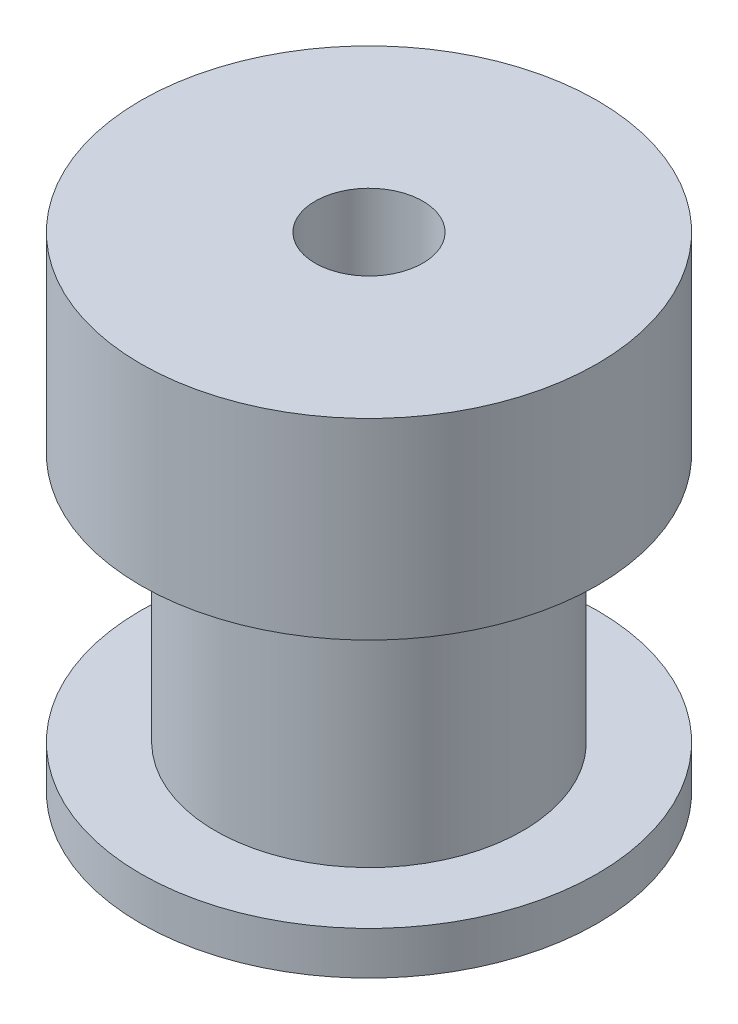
from build123d import *

# Parameters (mm, degrees)
SKETCH1_R           = 6.731
BOSS_EXTRUDE1_DEPTH = 14.3002
SKETCH2_W           = 2.1971
SKETCH2_H           = 7.366
SKETCH3_R           = 1.5875
CUT_EXTRUDE1_DEPTH  = 18.178720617


with BuildPart() as part:
    # Sketch1 → Boss-Extrude1 (new body)
    with BuildSketch(Plane(origin=(0, 0, 0), x_dir=(1, 0, 0), z_dir=(0, 1, 0))):
        with Locations(Location((0, 0, 0), (0, 0, 270))):
            Circle(SKETCH1_R)
    extrude(amount=BOSS_EXTRUDE1_DEPTH)

    # Sketch2 → Cut-Revolve1 (revolve, cut)
    with BuildSketch(Plane(origin=(0, 0, 0), x_dir=(0, 0, -1), z_dir=(1, 0, 0)), mode=Mode.PRIVATE) as cut_revolve1_sk:
        with Locations((-5.63245, 4.953)):
            Rectangle(SKETCH2_W, SKETCH2_H)
    revolve(cut_revolve1_sk.sketch.rotate(Axis((0, 0, 0), (0, 1, 0)), 180), axis=Axis((0, 0, 0), (0, 1, 0)), mode=Mode.SUBTRACT)

    # Sketch3 → Cut-Extrude1 (cut, through all)
    with BuildSketch(Plane(origin=(0, 14.3002, 0), x_dir=(1, 0, 0), z_dir=(0, 1, 0))):
        with Locations(Location((0, 0, 0), (0, 0, 270))):
            Circle(SKETCH3_R)
    extrude(amount=-CUT_EXTRUDE1_DEPTH, mode=Mode.SUBTRACT)


solid = part.part
